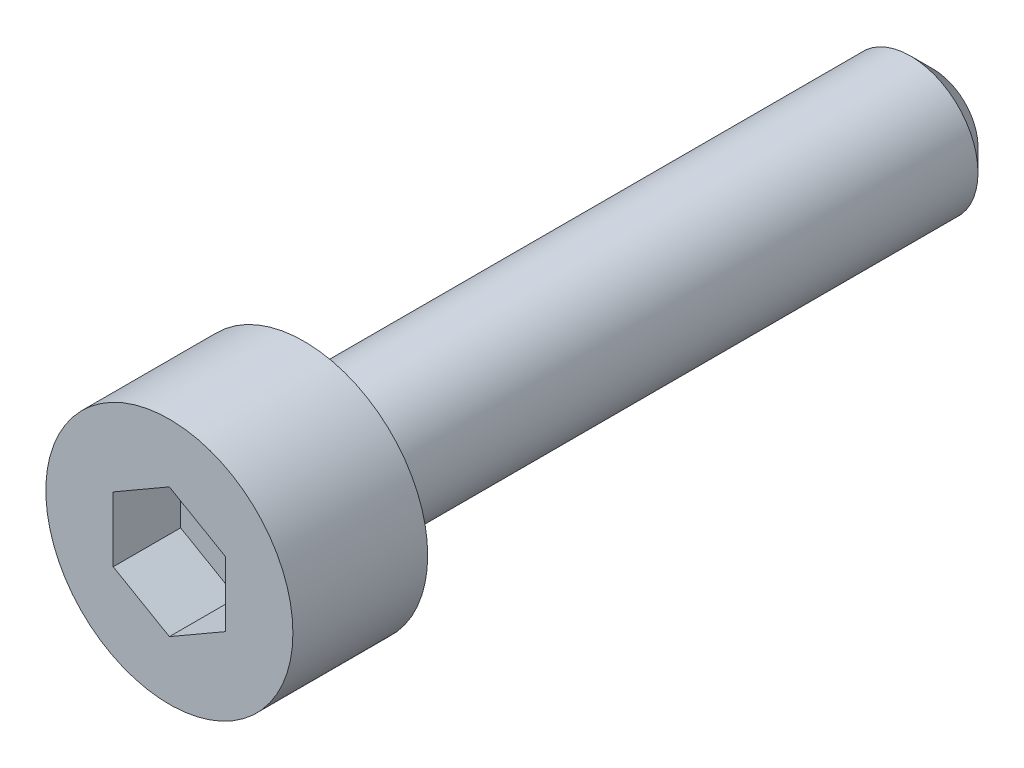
ISO-10303-21;
HEADER;
FILE_DESCRIPTION(('STEP AP214'),'2;1');
FILE_NAME('part.step','',(''),(''),'','','');
FILE_SCHEMA(('AUTOMOTIVE_DESIGN { 1 0 10303 214 1 1 1 1 }'));
ENDSEC;
DATA;
#1=APPLICATION_CONTEXT('core data for automotive mechanical design processes');
#2=APPLICATION_PROTOCOL_DEFINITION('international standard','automotive_design',2000,#1);
#3=PRODUCT_CONTEXT('',#1,'mechanical');
#4=PRODUCT('Part','Part','',(#3));
#5=PRODUCT_RELATED_PRODUCT_CATEGORY('part','',(#4));
#6=PRODUCT_DEFINITION_FORMATION('','',#4);
#7=PRODUCT_DEFINITION_CONTEXT('part definition',#1,'design');
#8=PRODUCT_DEFINITION('design','',#6,#7);
#9=PRODUCT_DEFINITION_SHAPE('','',#8);
#10=(LENGTH_UNIT() NAMED_UNIT(*) SI_UNIT(.MILLI.,.METRE.));
#11=(NAMED_UNIT(*) PLANE_ANGLE_UNIT() SI_UNIT($,.RADIAN.));
#12=(NAMED_UNIT(*) SI_UNIT($,.STERADIAN.) SOLID_ANGLE_UNIT());
#13=UNCERTAINTY_MEASURE_WITH_UNIT(LENGTH_MEASURE(1.E-05),#10,'distance_accuracy_value','');
#14=(GEOMETRIC_REPRESENTATION_CONTEXT(3) GLOBAL_UNCERTAINTY_ASSIGNED_CONTEXT((#13)) GLOBAL_UNIT_ASSIGNED_CONTEXT((#10,
#11,#12)) REPRESENTATION_CONTEXT('',''));
#15=CARTESIAN_POINT('',(0.,0.,0.));
#16=DIRECTION('',(0.,0.,1.));
#17=DIRECTION('',(1.,0.,0.));
#18=AXIS2_PLACEMENT_3D('',#15,#16,#17);
#19=CARTESIAN_POINT('',(0.,1.44337567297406,1.5));
#20=DIRECTION('',(-0.5,-0.86602540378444,0.));
#21=DIRECTION('',(0.86602540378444,-0.5,0.));
#22=AXIS2_PLACEMENT_3D('',#19,#20,#21);
#23=PLANE('',#22);
#24=DIRECTION('',(0.,0.,1.));
#25=VECTOR('',#24,1.);
#26=CARTESIAN_POINT('',(1.25,0.721687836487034,1.5));
#27=LINE('',#26,#25);
#28=CARTESIAN_POINT('',(1.25,0.721687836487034,1.5));
#29=VERTEX_POINT('',#28);
#30=CARTESIAN_POINT('',(1.25,0.721687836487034,3.));
#31=VERTEX_POINT('',#30);
#32=EDGE_CURVE('E65',#29,#31,#27,.T.);
#33=ORIENTED_EDGE('',*,*,#32,.T.);
#34=DIRECTION('',(0.866025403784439,-0.5,0.));
#35=VECTOR('',#34,1.);
#36=CARTESIAN_POINT('',(0.,1.44337567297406,3.));
#37=LINE('',#36,#35);
#38=CARTESIAN_POINT('',(0.,1.44337567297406,3.));
#39=VERTEX_POINT('',#38);
#40=EDGE_CURVE('E31',#39,#31,#37,.T.);
#41=ORIENTED_EDGE('',*,*,#40,.F.);
#42=DIRECTION('',(0.,0.,1.));
#43=VECTOR('',#42,1.);
#44=CARTESIAN_POINT('',(0.,1.44337567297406,1.5));
#45=LINE('',#44,#43);
#46=CARTESIAN_POINT('',(0.,1.44337567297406,1.5));
#47=VERTEX_POINT('',#46);
#48=EDGE_CURVE('E35',#47,#39,#45,.T.);
#49=ORIENTED_EDGE('',*,*,#48,.F.);
#50=DIRECTION('',(0.866025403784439,-0.5,0.));
#51=VECTOR('',#50,1.);
#52=CARTESIAN_POINT('',(0.,1.44337567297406,1.5));
#53=LINE('',#52,#51);
#54=EDGE_CURVE('E67',#47,#29,#53,.T.);
#55=ORIENTED_EDGE('',*,*,#54,.T.);
#56=EDGE_LOOP('',(#33,#41,#49,#55));
#57=FACE_BOUND('',#56,.T.);
#58=ADVANCED_FACE('F15',(#57),#23,.T.);
#59=CARTESIAN_POINT('',(1.25,-0.721687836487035,1.5));
#60=DIRECTION('',(1.,0.,0.));
#61=DIRECTION('',(0.,1.,0.));
#62=AXIS2_PLACEMENT_3D('',#59,#60,#61);
#63=PLANE('',#62);
#64=DIRECTION('',(0.,0.,1.));
#65=VECTOR('',#64,1.);
#66=CARTESIAN_POINT('',(1.25,-0.721687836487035,1.5));
#67=LINE('',#66,#65);
#68=CARTESIAN_POINT('',(1.25,-0.721687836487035,1.5));
#69=VERTEX_POINT('',#68);
#70=CARTESIAN_POINT('',(1.25,-0.721687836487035,3.));
#71=VERTEX_POINT('',#70);
#72=EDGE_CURVE('E73',#69,#71,#67,.T.);
#73=ORIENTED_EDGE('',*,*,#72,.T.);
#74=DIRECTION('',(0.,1.,0.));
#75=VECTOR('',#74,1.);
#76=CARTESIAN_POINT('',(1.25,-0.721687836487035,3.));
#77=LINE('',#76,#75);
#78=EDGE_CURVE('E76',#71,#31,#77,.T.);
#79=ORIENTED_EDGE('',*,*,#78,.T.);
#80=ORIENTED_EDGE('',*,*,#32,.F.);
#81=DIRECTION('',(0.,1.,0.));
#82=VECTOR('',#81,1.);
#83=CARTESIAN_POINT('',(1.25,-0.721687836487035,1.5));
#84=LINE('',#83,#82);
#85=EDGE_CURVE('E110',#69,#29,#84,.T.);
#86=ORIENTED_EDGE('',*,*,#85,.F.);
#87=EDGE_LOOP('',(#73,#79,#80,#86));
#88=FACE_BOUND('',#87,.T.);
#89=ADVANCED_FACE('F77',(#88),#63,.F.);
#90=CARTESIAN_POINT('',(0.,-1.44337567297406,1.5));
#91=DIRECTION('',(0.5,-0.86602540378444,0.));
#92=DIRECTION('',(0.86602540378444,0.5,0.));
#93=AXIS2_PLACEMENT_3D('',#90,#91,#92);
#94=PLANE('',#93);
#95=DIRECTION('',(0.,0.,1.));
#96=VECTOR('',#95,1.);
#97=CARTESIAN_POINT('',(0.,-1.44337567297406,1.5));
#98=LINE('',#97,#96);
#99=CARTESIAN_POINT('',(0.,-1.44337567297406,1.5));
#100=VERTEX_POINT('',#99);
#101=CARTESIAN_POINT('',(0.,-1.44337567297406,3.));
#102=VERTEX_POINT('',#101);
#103=EDGE_CURVE('E123',#100,#102,#98,.T.);
#104=ORIENTED_EDGE('',*,*,#103,.T.);
#105=DIRECTION('',(0.86602540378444,0.5,0.));
#106=VECTOR('',#105,1.);
#107=CARTESIAN_POINT('',(0.,-1.44337567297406,3.));
#108=LINE('',#107,#106);
#109=EDGE_CURVE('E82',#102,#71,#108,.T.);
#110=ORIENTED_EDGE('',*,*,#109,.T.);
#111=ORIENTED_EDGE('',*,*,#72,.F.);
#112=DIRECTION('',(0.86602540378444,0.5,0.));
#113=VECTOR('',#112,1.);
#114=CARTESIAN_POINT('',(0.,-1.44337567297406,1.5));
#115=LINE('',#114,#113);
#116=EDGE_CURVE('E106',#100,#69,#115,.T.);
#117=ORIENTED_EDGE('',*,*,#116,.F.);
#118=EDGE_LOOP('',(#104,#110,#111,#117));
#119=FACE_BOUND('',#118,.T.);
#120=ADVANCED_FACE('F160',(#119),#94,.F.);
#121=CARTESIAN_POINT('',(0.,-1.44337567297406,1.5));
#122=DIRECTION('',(0.5,0.86602540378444,0.));
#123=DIRECTION('',(-0.86602540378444,0.5,0.));
#124=AXIS2_PLACEMENT_3D('',#121,#122,#123);
#125=PLANE('',#124);
#126=DIRECTION('',(0.,0.,1.));
#127=VECTOR('',#126,1.);
#128=CARTESIAN_POINT('',(-1.25,-0.721687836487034,1.5));
#129=LINE('',#128,#127);
#130=CARTESIAN_POINT('',(-1.25,-0.721687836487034,1.5));
#131=VERTEX_POINT('',#130);
#132=CARTESIAN_POINT('',(-1.25,-0.721687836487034,3.));
#133=VERTEX_POINT('',#132);
#134=EDGE_CURVE('E120',#131,#133,#129,.T.);
#135=ORIENTED_EDGE('',*,*,#134,.T.);
#136=DIRECTION('',(-0.86602540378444,0.5,0.));
#137=VECTOR('',#136,1.);
#138=CARTESIAN_POINT('',(0.,-1.44337567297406,3.));
#139=LINE('',#138,#137);
#140=EDGE_CURVE('E209',#102,#133,#139,.T.);
#141=ORIENTED_EDGE('',*,*,#140,.F.);
#142=ORIENTED_EDGE('',*,*,#103,.F.);
#143=DIRECTION('',(-0.86602540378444,0.5,0.));
#144=VECTOR('',#143,1.);
#145=CARTESIAN_POINT('',(0.,-1.44337567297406,1.5));
#146=LINE('',#145,#144);
#147=EDGE_CURVE('E102',#100,#131,#146,.T.);
#148=ORIENTED_EDGE('',*,*,#147,.T.);
#149=EDGE_LOOP('',(#135,#141,#142,#148));
#150=FACE_BOUND('',#149,.T.);
#151=ADVANCED_FACE('F172',(#150),#125,.T.);
#152=CARTESIAN_POINT('',(-1.25,0.721687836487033,1.5));
#153=DIRECTION('',(-1.,0.,0.));
#154=DIRECTION('',(0.,-1.,0.));
#155=AXIS2_PLACEMENT_3D('',#152,#153,#154);
#156=PLANE('',#155);
#157=DIRECTION('',(0.,0.,1.));
#158=VECTOR('',#157,1.);
#159=CARTESIAN_POINT('',(-1.25,0.721687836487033,1.5));
#160=LINE('',#159,#158);
#161=CARTESIAN_POINT('',(-1.25,0.721687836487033,1.5));
#162=VERTEX_POINT('',#161);
#163=CARTESIAN_POINT('',(-1.25,0.721687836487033,3.));
#164=VERTEX_POINT('',#163);
#165=EDGE_CURVE('E117',#162,#164,#160,.T.);
#166=ORIENTED_EDGE('',*,*,#165,.T.);
#167=DIRECTION('',(0.,-1.,0.));
#168=VECTOR('',#167,1.);
#169=CARTESIAN_POINT('',(-1.25,0.721687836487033,3.));
#170=LINE('',#169,#168);
#171=EDGE_CURVE('E212',#164,#133,#170,.T.);
#172=ORIENTED_EDGE('',*,*,#171,.T.);
#173=ORIENTED_EDGE('',*,*,#134,.F.);
#174=DIRECTION('',(0.,-1.,0.));
#175=VECTOR('',#174,1.);
#176=CARTESIAN_POINT('',(-1.25,0.721687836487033,1.5));
#177=LINE('',#176,#175);
#178=EDGE_CURVE('E98',#162,#131,#177,.T.);
#179=ORIENTED_EDGE('',*,*,#178,.F.);
#180=EDGE_LOOP('',(#166,#172,#173,#179));
#181=FACE_BOUND('',#180,.T.);
#182=ADVANCED_FACE('F168',(#181),#156,.F.);
#183=CARTESIAN_POINT('',(0.,1.44337567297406,1.5));
#184=DIRECTION('',(-0.5,0.86602540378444,0.));
#185=DIRECTION('',(-0.86602540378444,-0.5,0.));
#186=AXIS2_PLACEMENT_3D('',#183,#184,#185);
#187=PLANE('',#186);
#188=DIRECTION('',(-0.86602540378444,-0.5,0.));
#189=VECTOR('',#188,1.);
#190=CARTESIAN_POINT('',(0.,1.44337567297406,1.5));
#191=LINE('',#190,#189);
#192=EDGE_CURVE('E94',#47,#162,#191,.T.);
#193=ORIENTED_EDGE('',*,*,#192,.F.);
#194=ORIENTED_EDGE('',*,*,#48,.T.);
#195=DIRECTION('',(-0.86602540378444,-0.5,0.));
#196=VECTOR('',#195,1.);
#197=CARTESIAN_POINT('',(0.,1.44337567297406,3.));
#198=LINE('',#197,#196);
#199=EDGE_CURVE('E88',#39,#164,#198,.T.);
#200=ORIENTED_EDGE('',*,*,#199,.T.);
#201=ORIENTED_EDGE('',*,*,#165,.F.);
#202=EDGE_LOOP('',(#193,#194,#200,#201));
#203=FACE_BOUND('',#202,.T.);
#204=ADVANCED_FACE('F165',(#203),#187,.F.);
#205=CARTESIAN_POINT('',(1.25,0.721687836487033,1.5));
#206=DIRECTION('',(0.,0.,1.));
#207=DIRECTION('',(1.,0.,0.));
#208=AXIS2_PLACEMENT_3D('',#205,#206,#207);
#209=PLANE('',#208);
#210=ORIENTED_EDGE('',*,*,#54,.F.);
#211=ORIENTED_EDGE('',*,*,#192,.T.);
#212=ORIENTED_EDGE('',*,*,#178,.T.);
#213=ORIENTED_EDGE('',*,*,#147,.F.);
#214=ORIENTED_EDGE('',*,*,#116,.T.);
#215=ORIENTED_EDGE('',*,*,#85,.T.);
#216=EDGE_LOOP('',(#210,#211,#212,#213,#214,#215));
#217=FACE_BOUND('',#216,.T.);
#218=ADVANCED_FACE('F164',(#217),#209,.T.);
#219=CARTESIAN_POINT('',(0.,0.,3.));
#220=DIRECTION('',(0.,0.,1.));
#221=DIRECTION('',(1.,0.,0.));
#222=AXIS2_PLACEMENT_3D('',#219,#220,#221);
#223=PLANE('',#222);
#224=CARTESIAN_POINT('',(0.,0.,3.));
#225=DIRECTION('',(0.,0.,1.));
#226=DIRECTION('',(1.,0.,0.));
#227=AXIS2_PLACEMENT_3D('',#224,#225,#226);
#228=CIRCLE('',#227,2.75);
#229=CARTESIAN_POINT('',(2.75,0.,3.));
#230=VERTEX_POINT('',#229);
#231=EDGE_CURVE('E135',#230,#230,#228,.T.);
#232=ORIENTED_EDGE('',*,*,#231,.T.);
#233=EDGE_LOOP('',(#232));
#234=FACE_BOUND('',#233,.T.);
#235=ORIENTED_EDGE('',*,*,#199,.F.);
#236=ORIENTED_EDGE('',*,*,#40,.T.);
#237=ORIENTED_EDGE('',*,*,#78,.F.);
#238=ORIENTED_EDGE('',*,*,#109,.F.);
#239=ORIENTED_EDGE('',*,*,#140,.T.);
#240=ORIENTED_EDGE('',*,*,#171,.F.);
#241=EDGE_LOOP('',(#235,#236,#237,#238,#239,#240));
#242=FACE_BOUND('',#241,.T.);
#243=ADVANCED_FACE('F85',(#234,#242),#223,.T.);
#244=CARTESIAN_POINT('',(0.,0.,8.));
#245=DIRECTION('',(0.,0.,1.));
#246=DIRECTION('',(1.,0.,0.));
#247=AXIS2_PLACEMENT_3D('',#244,#245,#246);
#248=CYLINDRICAL_SURFACE('',#247,2.75);
#249=CARTESIAN_POINT('',(0.,0.,0.));
#250=DIRECTION('',(0.,0.,1.));
#251=DIRECTION('',(1.,0.,0.));
#252=AXIS2_PLACEMENT_3D('',#249,#250,#251);
#253=CIRCLE('',#252,2.75);
#254=CARTESIAN_POINT('',(2.75,0.,0.));
#255=VERTEX_POINT('',#254);
#256=EDGE_CURVE('E131',#255,#255,#253,.T.);
#257=ORIENTED_EDGE('',*,*,#256,.T.);
#258=EDGE_LOOP('',(#257));
#259=FACE_BOUND('',#258,.T.);
#260=ORIENTED_EDGE('',*,*,#231,.F.);
#261=EDGE_LOOP('',(#260));
#262=FACE_BOUND('',#261,.T.);
#263=ADVANCED_FACE('F186',(#259,#262),#248,.T.);
#264=CARTESIAN_POINT('',(2.75,0.,0.));
#265=DIRECTION('',(0.,0.,-1.));
#266=DIRECTION('',(-1.,0.,0.));
#267=AXIS2_PLACEMENT_3D('',#264,#265,#266);
#268=PLANE('',#267);
#269=CARTESIAN_POINT('',(0.,0.,0.));
#270=DIRECTION('',(0.,0.,1.));
#271=DIRECTION('',(1.,0.,0.));
#272=AXIS2_PLACEMENT_3D('',#269,#270,#271);
#273=CIRCLE('',#272,1.5);
#274=CARTESIAN_POINT('',(1.5,0.,0.));
#275=VERTEX_POINT('',#274);
#276=EDGE_CURVE('E72',#275,#275,#273,.T.);
#277=ORIENTED_EDGE('',*,*,#276,.T.);
#278=EDGE_LOOP('',(#277));
#279=FACE_BOUND('',#278,.T.);
#280=ORIENTED_EDGE('',*,*,#256,.F.);
#281=EDGE_LOOP('',(#280));
#282=FACE_BOUND('',#281,.T.);
#283=ADVANCED_FACE('F182',(#279,#282),#268,.T.);
#284=CARTESIAN_POINT('',(0.,0.,8.));
#285=DIRECTION('',(0.,0.,1.));
#286=DIRECTION('',(1.,0.,0.));
#287=AXIS2_PLACEMENT_3D('',#284,#285,#286);
#288=CYLINDRICAL_SURFACE('',#287,1.5);
#289=CARTESIAN_POINT('',(0.,0.,-13.5));
#290=DIRECTION('',(0.,0.,-1.));
#291=DIRECTION('',(-1.,0.,0.));
#292=AXIS2_PLACEMENT_3D('',#289,#290,#291);
#293=CIRCLE('',#292,1.5);
#294=CARTESIAN_POINT('',(-1.5,0.,-13.5));
#295=VERTEX_POINT('',#294);
#296=EDGE_CURVE('E9',#295,#295,#293,.F.);
#297=ORIENTED_EDGE('',*,*,#296,.T.);
#298=EDGE_LOOP('',(#297));
#299=FACE_BOUND('',#298,.T.);
#300=ORIENTED_EDGE('',*,*,#276,.F.);
#301=EDGE_LOOP('',(#300));
#302=FACE_BOUND('',#301,.T.);
#303=ADVANCED_FACE('F151',(#299,#302),#288,.T.);
#304=CARTESIAN_POINT('',(0.,0.,-14.));
#305=DIRECTION('',(0.,0.,-1.));
#306=DIRECTION('',(-1.,0.,0.));
#307=AXIS2_PLACEMENT_3D('',#304,#305,#306);
#308=PLANE('',#307);
#309=CARTESIAN_POINT('',(0.,0.,-14.));
#310=DIRECTION('',(0.,0.,-1.));
#311=DIRECTION('',(-1.,0.,0.));
#312=AXIS2_PLACEMENT_3D('',#309,#310,#311);
#313=CIRCLE('',#312,1.);
#314=CARTESIAN_POINT('',(-1.,0.,-14.));
#315=VERTEX_POINT('',#314);
#316=EDGE_CURVE('E24',#315,#315,#313,.T.);
#317=ORIENTED_EDGE('',*,*,#316,.T.);
#318=EDGE_LOOP('',(#317));
#319=FACE_BOUND('',#318,.T.);
#320=ADVANCED_FACE('F142',(#319),#308,.T.);
#321=CARTESIAN_POINT('',(0.,0.,-14.));
#322=DIRECTION('',(0.,0.,1.));
#323=DIRECTION('',(1.,0.,0.));
#324=AXIS2_PLACEMENT_3D('',#321,#322,#323);
#325=CONICAL_SURFACE('',#324,1.,0.785398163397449);
#326=ORIENTED_EDGE('',*,*,#296,.F.);
#327=EDGE_LOOP('',(#326));
#328=FACE_BOUND('',#327,.T.);
#329=ORIENTED_EDGE('',*,*,#316,.F.);
#330=EDGE_LOOP('',(#329));
#331=FACE_BOUND('',#330,.T.);
#332=ADVANCED_FACE('F17',(#328,#331),#325,.T.);
#333=CLOSED_SHELL('',(#58,#89,#120,#151,#182,#204,#218,#243,#263,#283,#303,#320,#332));
#334=MANIFOLD_SOLID_BREP('B1',#333);
#335=ADVANCED_BREP_SHAPE_REPRESENTATION('',(#18,#334),#14);
#336=SHAPE_DEFINITION_REPRESENTATION(#9,#335);
ENDSEC;
END-ISO-10303-21;
